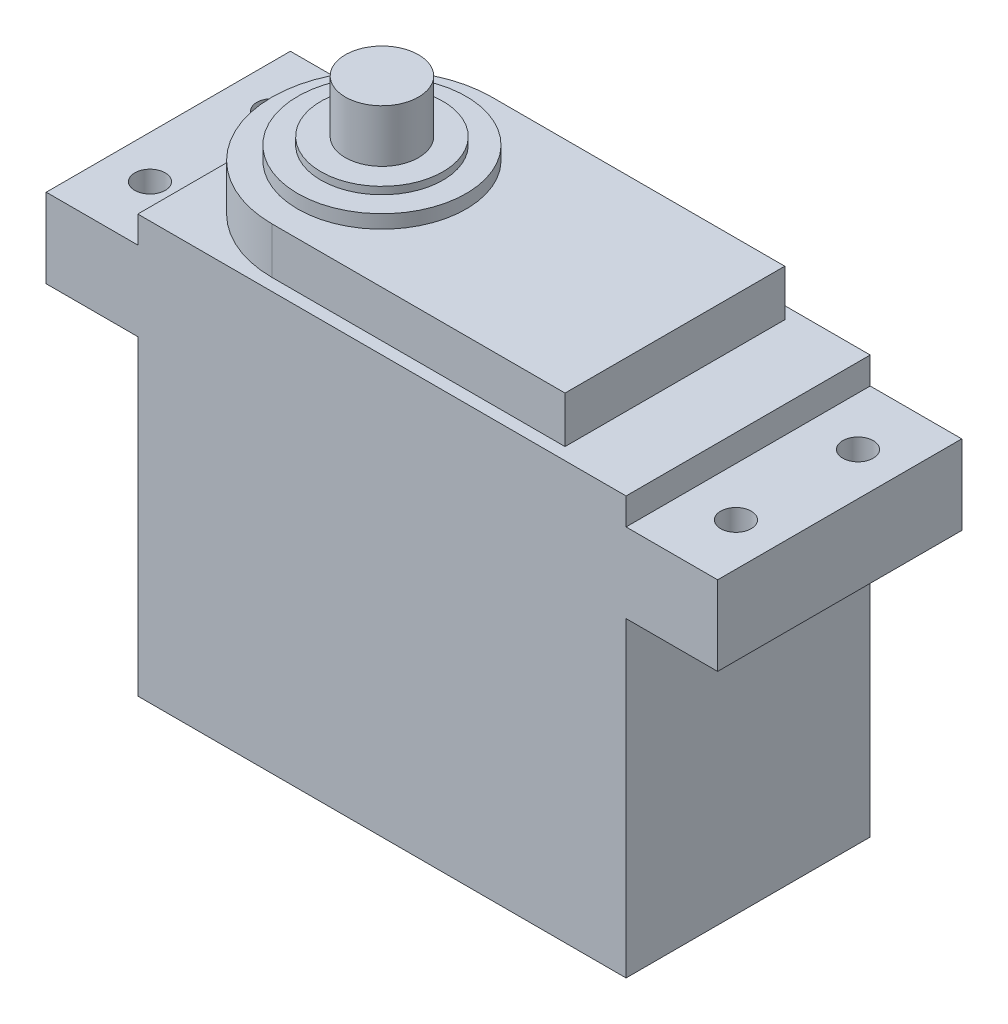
ISO-10303-21;
HEADER;
FILE_DESCRIPTION(('STEP AP214'),'2;1');
FILE_NAME('part.step','',(''),(''),'','','');
FILE_SCHEMA(('AUTOMOTIVE_DESIGN { 1 0 10303 214 1 1 1 1 }'));
ENDSEC;
DATA;
#1=APPLICATION_CONTEXT('core data for automotive mechanical design processes');
#2=APPLICATION_PROTOCOL_DEFINITION('international standard','automotive_design',2000,#1);
#3=PRODUCT_CONTEXT('',#1,'mechanical');
#4=PRODUCT('Part','Part','',(#3));
#5=PRODUCT_RELATED_PRODUCT_CATEGORY('part','',(#4));
#6=PRODUCT_DEFINITION_FORMATION('','',#4);
#7=PRODUCT_DEFINITION_CONTEXT('part definition',#1,'design');
#8=PRODUCT_DEFINITION('design','',#6,#7);
#9=PRODUCT_DEFINITION_SHAPE('','',#8);
#10=(LENGTH_UNIT() NAMED_UNIT(*) SI_UNIT(.MILLI.,.METRE.));
#11=(NAMED_UNIT(*) PLANE_ANGLE_UNIT() SI_UNIT($,.RADIAN.));
#12=(NAMED_UNIT(*) SI_UNIT($,.STERADIAN.) SOLID_ANGLE_UNIT());
#13=UNCERTAINTY_MEASURE_WITH_UNIT(LENGTH_MEASURE(1.E-05),#10,'distance_accuracy_value','');
#14=(GEOMETRIC_REPRESENTATION_CONTEXT(3) GLOBAL_UNCERTAINTY_ASSIGNED_CONTEXT((#13)) GLOBAL_UNIT_ASSIGNED_CONTEXT((#10,
#11,#12)) REPRESENTATION_CONTEXT('',''));
#15=CARTESIAN_POINT('',(0.,0.,0.));
#16=DIRECTION('',(0.,0.,1.));
#17=DIRECTION('',(1.,0.,0.));
#18=AXIS2_PLACEMENT_3D('',#15,#16,#17);
#19=CARTESIAN_POINT('',(0.,0.,10.));
#20=DIRECTION('',(1.,0.,0.));
#21=DIRECTION('',(0.,0.,-1.));
#22=AXIS2_PLACEMENT_3D('',#19,#20,#21);
#23=PLANE('',#22);
#24=DIRECTION('',(0.,-1.,0.));
#25=VECTOR('',#24,1.);
#26=CARTESIAN_POINT('',(0.,0.,-10.));
#27=LINE('',#26,#25);
#28=CARTESIAN_POINT('',(0.,25.5,-10.));
#29=VERTEX_POINT('',#28);
#30=CARTESIAN_POINT('',(0.,0.,-10.));
#31=VERTEX_POINT('',#30);
#32=EDGE_CURVE('E305',#29,#31,#27,.T.);
#33=ORIENTED_EDGE('',*,*,#32,.T.);
#34=DIRECTION('',(0.,0.,-1.));
#35=VECTOR('',#34,1.);
#36=CARTESIAN_POINT('',(0.,0.,10.));
#37=LINE('',#36,#35);
#38=CARTESIAN_POINT('',(0.,0.,10.));
#39=VERTEX_POINT('',#38);
#40=EDGE_CURVE('E12',#39,#31,#37,.T.);
#41=ORIENTED_EDGE('',*,*,#40,.F.);
#42=DIRECTION('',(0.,-1.,0.));
#43=VECTOR('',#42,1.);
#44=CARTESIAN_POINT('',(0.,0.,10.));
#45=LINE('',#44,#43);
#46=CARTESIAN_POINT('',(0.,25.5,10.));
#47=VERTEX_POINT('',#46);
#48=EDGE_CURVE('E278',#47,#39,#45,.T.);
#49=ORIENTED_EDGE('',*,*,#48,.F.);
#50=DIRECTION('',(0.,0.,-1.));
#51=VECTOR('',#50,1.);
#52=CARTESIAN_POINT('',(0.,25.5,10.));
#53=LINE('',#52,#51);
#54=EDGE_CURVE('E304',#47,#29,#53,.T.);
#55=ORIENTED_EDGE('',*,*,#54,.T.);
#56=EDGE_LOOP('',(#33,#41,#49,#55));
#57=FACE_BOUND('',#56,.T.);
#58=DIRECTION('',(0.,-1.,0.));
#59=VECTOR('',#58,1.);
#60=CARTESIAN_POINT('',(0.,3.5,-3.));
#61=LINE('',#60,#59);
#62=CARTESIAN_POINT('',(0.,3.5,-3.));
#63=VERTEX_POINT('',#62);
#64=CARTESIAN_POINT('',(0.,0.5,-3.));
#65=VERTEX_POINT('',#64);
#66=EDGE_CURVE('E199',#63,#65,#61,.T.);
#67=ORIENTED_EDGE('',*,*,#66,.F.);
#68=DIRECTION('',(0.,0.,-1.));
#69=VECTOR('',#68,1.);
#70=CARTESIAN_POINT('',(0.,3.5,-3.));
#71=LINE('',#70,#69);
#72=CARTESIAN_POINT('',(0.,3.5,3.));
#73=VERTEX_POINT('',#72);
#74=EDGE_CURVE('E196',#73,#63,#71,.T.);
#75=ORIENTED_EDGE('',*,*,#74,.F.);
#76=DIRECTION('',(0.,1.,0.));
#77=VECTOR('',#76,1.);
#78=CARTESIAN_POINT('',(0.,3.5,3.));
#79=LINE('',#78,#77);
#80=CARTESIAN_POINT('',(0.,0.5,3.));
#81=VERTEX_POINT('',#80);
#82=EDGE_CURVE('E62',#81,#73,#79,.T.);
#83=ORIENTED_EDGE('',*,*,#82,.F.);
#84=DIRECTION('',(0.,0.,1.));
#85=VECTOR('',#84,1.);
#86=CARTESIAN_POINT('',(0.,0.5,-3.));
#87=LINE('',#86,#85);
#88=EDGE_CURVE('E57',#65,#81,#87,.T.);
#89=ORIENTED_EDGE('',*,*,#88,.F.);
#90=EDGE_LOOP('',(#67,#75,#83,#89));
#91=FACE_BOUND('',#90,.T.);
#92=ADVANCED_FACE('F41',(#57,#91),#23,.F.);
#93=CARTESIAN_POINT('',(0.,39.1,10.));
#94=DIRECTION('',(0.,1.,0.));
#95=DIRECTION('',(0.,0.,1.));
#96=AXIS2_PLACEMENT_3D('',#93,#94,#95);
#97=PLANE('',#96);
#98=CARTESIAN_POINT('',(10.,39.1,0.));
#99=DIRECTION('',(0.,1.,0.));
#100=DIRECTION('',(0.,0.,1.));
#101=AXIS2_PLACEMENT_3D('',#98,#99,#100);
#102=CIRCLE('',#101,6.9);
#103=CARTESIAN_POINT('',(10.,39.1,6.9));
#104=VERTEX_POINT('',#103);
#105=EDGE_CURVE('E220',#104,#104,#102,.T.);
#106=ORIENTED_EDGE('',*,*,#105,.T.);
#107=EDGE_LOOP('',(#106));
#108=FACE_BOUND('',#107,.T.);
#109=CARTESIAN_POINT('',(10.,39.1,0.));
#110=DIRECTION('',(0.,1.,0.));
#111=DIRECTION('',(0.,0.,1.));
#112=AXIS2_PLACEMENT_3D('',#109,#110,#111);
#113=CIRCLE('',#112,5.);
#114=CARTESIAN_POINT('',(10.,39.1,5.));
#115=VERTEX_POINT('',#114);
#116=EDGE_CURVE('E211',#115,#115,#113,.T.);
#117=ORIENTED_EDGE('',*,*,#116,.F.);
#118=EDGE_LOOP('',(#117));
#119=FACE_BOUND('',#118,.T.);
#120=ADVANCED_FACE('F383',(#108,#119),#97,.T.);
#121=CARTESIAN_POINT('',(0.,38.,10.));
#122=DIRECTION('',(0.,1.,0.));
#123=DIRECTION('',(0.,0.,1.));
#124=AXIS2_PLACEMENT_3D('',#121,#122,#123);
#125=PLANE('',#124);
#126=DIRECTION('',(1.,0.,0.));
#127=VECTOR('',#126,1.);
#128=CARTESIAN_POINT('',(34.,38.,9.));
#129=LINE('',#128,#127);
#130=CARTESIAN_POINT('',(10.,38.,9.));
#131=VERTEX_POINT('',#130);
#132=CARTESIAN_POINT('',(34.,38.,9.));
#133=VERTEX_POINT('',#132);
#134=EDGE_CURVE('E227',#131,#133,#129,.T.);
#135=ORIENTED_EDGE('',*,*,#134,.T.);
#136=DIRECTION('',(0.,0.,-1.));
#137=VECTOR('',#136,1.);
#138=CARTESIAN_POINT('',(34.,38.,-9.));
#139=LINE('',#138,#137);
#140=CARTESIAN_POINT('',(34.,38.,-9.));
#141=VERTEX_POINT('',#140);
#142=EDGE_CURVE('E247',#133,#141,#139,.T.);
#143=ORIENTED_EDGE('',*,*,#142,.T.);
#144=DIRECTION('',(-1.,0.,0.));
#145=VECTOR('',#144,1.);
#146=CARTESIAN_POINT('',(10.,38.,-9.));
#147=LINE('',#146,#145);
#148=CARTESIAN_POINT('',(10.,38.,-9.));
#149=VERTEX_POINT('',#148);
#150=EDGE_CURVE('E244',#141,#149,#147,.T.);
#151=ORIENTED_EDGE('',*,*,#150,.T.);
#152=CARTESIAN_POINT('',(10.,38.,0.));
#153=DIRECTION('',(0.,1.,0.));
#154=DIRECTION('',(0.,0.,1.));
#155=AXIS2_PLACEMENT_3D('',#152,#153,#154);
#156=CIRCLE('',#155,9.);
#157=EDGE_CURVE('E240',#149,#131,#156,.T.);
#158=ORIENTED_EDGE('',*,*,#157,.T.);
#159=EDGE_LOOP('',(#135,#143,#151,#158));
#160=FACE_BOUND('',#159,.T.);
#161=CARTESIAN_POINT('',(10.,38.,0.));
#162=DIRECTION('',(0.,1.,0.));
#163=DIRECTION('',(0.,0.,1.));
#164=AXIS2_PLACEMENT_3D('',#161,#162,#163);
#165=CIRCLE('',#164,6.9);
#166=CARTESIAN_POINT('',(10.,38.,6.9));
#167=VERTEX_POINT('',#166);
#168=EDGE_CURVE('E217',#167,#167,#165,.T.);
#169=ORIENTED_EDGE('',*,*,#168,.F.);
#170=EDGE_LOOP('',(#169));
#171=FACE_BOUND('',#170,.T.);
#172=ADVANCED_FACE('F388',(#160,#171),#125,.T.);
#173=CARTESIAN_POINT('',(0.,34.2,10.));
#174=DIRECTION('',(0.,-1.,0.));
#175=DIRECTION('',(0.,0.,-1.));
#176=AXIS2_PLACEMENT_3D('',#173,#174,#175);
#177=PLANE('',#176);
#178=DIRECTION('',(-1.,0.,0.));
#179=VECTOR('',#178,1.);
#180=CARTESIAN_POINT('',(0.,34.2,-10.));
#181=LINE('',#180,#179);
#182=CARTESIAN_POINT('',(40.,34.2,-10.));
#183=VERTEX_POINT('',#182);
#184=CARTESIAN_POINT('',(0.,34.2,-10.));
#185=VERTEX_POINT('',#184);
#186=EDGE_CURVE('E320',#183,#185,#181,.T.);
#187=ORIENTED_EDGE('',*,*,#186,.T.);
#188=DIRECTION('',(0.,0.,-1.));
#189=VECTOR('',#188,1.);
#190=CARTESIAN_POINT('',(0.,34.2,10.));
#191=LINE('',#190,#189);
#192=CARTESIAN_POINT('',(0.,34.2,10.));
#193=VERTEX_POINT('',#192);
#194=EDGE_CURVE('E340',#193,#185,#191,.T.);
#195=ORIENTED_EDGE('',*,*,#194,.F.);
#196=DIRECTION('',(-1.,0.,0.));
#197=VECTOR('',#196,1.);
#198=CARTESIAN_POINT('',(0.,34.2,10.));
#199=LINE('',#198,#197);
#200=CARTESIAN_POINT('',(40.,34.2,10.));
#201=VERTEX_POINT('',#200);
#202=EDGE_CURVE('E294',#201,#193,#199,.T.);
#203=ORIENTED_EDGE('',*,*,#202,.F.);
#204=DIRECTION('',(0.,0.,-1.));
#205=VECTOR('',#204,1.);
#206=CARTESIAN_POINT('',(40.,34.2,10.));
#207=LINE('',#206,#205);
#208=EDGE_CURVE('E343',#201,#183,#207,.T.);
#209=ORIENTED_EDGE('',*,*,#208,.T.);
#210=EDGE_LOOP('',(#187,#195,#203,#209));
#211=FACE_BOUND('',#210,.T.);
#212=DIRECTION('',(0.,0.,-1.));
#213=VECTOR('',#212,1.);
#214=CARTESIAN_POINT('',(34.,34.2,-9.));
#215=LINE('',#214,#213);
#216=CARTESIAN_POINT('',(34.,34.2,9.));
#217=VERTEX_POINT('',#216);
#218=CARTESIAN_POINT('',(34.,34.2,-9.));
#219=VERTEX_POINT('',#218);
#220=EDGE_CURVE('E237',#217,#219,#215,.T.);
#221=ORIENTED_EDGE('',*,*,#220,.F.);
#222=DIRECTION('',(1.,0.,0.));
#223=VECTOR('',#222,1.);
#224=CARTESIAN_POINT('',(34.,34.2,9.));
#225=LINE('',#224,#223);
#226=CARTESIAN_POINT('',(10.,34.2,9.));
#227=VERTEX_POINT('',#226);
#228=EDGE_CURVE('E224',#227,#217,#225,.T.);
#229=ORIENTED_EDGE('',*,*,#228,.F.);
#230=CARTESIAN_POINT('',(10.,34.2,0.));
#231=DIRECTION('',(0.,1.,0.));
#232=DIRECTION('',(0.,0.,1.));
#233=AXIS2_PLACEMENT_3D('',#230,#231,#232);
#234=CIRCLE('',#233,9.);
#235=CARTESIAN_POINT('',(10.,34.2,-9.));
#236=VERTEX_POINT('',#235);
#237=EDGE_CURVE('E229',#236,#227,#234,.T.);
#238=ORIENTED_EDGE('',*,*,#237,.F.);
#239=DIRECTION('',(-1.,0.,0.));
#240=VECTOR('',#239,1.);
#241=CARTESIAN_POINT('',(10.,34.2,-9.));
#242=LINE('',#241,#240);
#243=EDGE_CURVE('E233',#219,#236,#242,.T.);
#244=ORIENTED_EDGE('',*,*,#243,.F.);
#245=EDGE_LOOP('',(#221,#229,#238,#244));
#246=FACE_BOUND('',#245,.T.);
#247=ADVANCED_FACE('F505',(#211,#246),#177,.F.);
#248=CARTESIAN_POINT('',(0.,0.,10.));
#249=DIRECTION('',(0.,1.,0.));
#250=DIRECTION('',(0.,0.,1.));
#251=AXIS2_PLACEMENT_3D('',#248,#249,#250);
#252=PLANE('',#251);
#253=DIRECTION('',(1.,0.,0.));
#254=VECTOR('',#253,1.);
#255=CARTESIAN_POINT('',(0.,0.,-10.));
#256=LINE('',#255,#254);
#257=CARTESIAN_POINT('',(40.,0.,-10.));
#258=VERTEX_POINT('',#257);
#259=EDGE_CURVE('E308',#31,#258,#256,.T.);
#260=ORIENTED_EDGE('',*,*,#259,.T.);
#261=DIRECTION('',(0.,0.,-1.));
#262=VECTOR('',#261,1.);
#263=CARTESIAN_POINT('',(40.,0.,10.));
#264=LINE('',#263,#262);
#265=CARTESIAN_POINT('',(40.,0.,10.));
#266=VERTEX_POINT('',#265);
#267=EDGE_CURVE('E49',#266,#258,#264,.T.);
#268=ORIENTED_EDGE('',*,*,#267,.F.);
#269=DIRECTION('',(1.,0.,0.));
#270=VECTOR('',#269,1.);
#271=CARTESIAN_POINT('',(0.,0.,10.));
#272=LINE('',#271,#270);
#273=EDGE_CURVE('E281',#39,#266,#272,.T.);
#274=ORIENTED_EDGE('',*,*,#273,.F.);
#275=ORIENTED_EDGE('',*,*,#40,.T.);
#276=EDGE_LOOP('',(#260,#268,#274,#275));
#277=FACE_BOUND('',#276,.T.);
#278=ADVANCED_FACE('F553',(#277),#252,.F.);
#279=CARTESIAN_POINT('',(40.,0.,10.));
#280=DIRECTION('',(-1.,0.,0.));
#281=DIRECTION('',(0.,0.,1.));
#282=AXIS2_PLACEMENT_3D('',#279,#280,#281);
#283=PLANE('',#282);
#284=DIRECTION('',(0.,1.,0.));
#285=VECTOR('',#284,1.);
#286=CARTESIAN_POINT('',(40.,0.,-10.));
#287=LINE('',#286,#285);
#288=CARTESIAN_POINT('',(40.,25.5,-10.));
#289=VERTEX_POINT('',#288);
#290=EDGE_CURVE('E310',#258,#289,#287,.T.);
#291=ORIENTED_EDGE('',*,*,#290,.T.);
#292=DIRECTION('',(0.,0.,-1.));
#293=VECTOR('',#292,1.);
#294=CARTESIAN_POINT('',(40.,25.5,10.));
#295=LINE('',#294,#293);
#296=CARTESIAN_POINT('',(40.,25.5,10.));
#297=VERTEX_POINT('',#296);
#298=EDGE_CURVE('E355',#297,#289,#295,.T.);
#299=ORIENTED_EDGE('',*,*,#298,.F.);
#300=DIRECTION('',(0.,1.,0.));
#301=VECTOR('',#300,1.);
#302=CARTESIAN_POINT('',(40.,0.,10.));
#303=LINE('',#302,#301);
#304=EDGE_CURVE('E284',#266,#297,#303,.T.);
#305=ORIENTED_EDGE('',*,*,#304,.F.);
#306=ORIENTED_EDGE('',*,*,#267,.T.);
#307=EDGE_LOOP('',(#291,#299,#305,#306));
#308=FACE_BOUND('',#307,.T.);
#309=ADVANCED_FACE('F522',(#308),#283,.F.);
#310=CARTESIAN_POINT('',(40.,25.5,10.));
#311=DIRECTION('',(0.,1.,0.));
#312=DIRECTION('',(0.,0.,1.));
#313=AXIS2_PLACEMENT_3D('',#310,#311,#312);
#314=PLANE('',#313);
#315=CARTESIAN_POINT('',(44.,25.5,-4.99999999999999));
#316=DIRECTION('',(0.,1.,0.));
#317=DIRECTION('',(0.,0.,1.));
#318=AXIS2_PLACEMENT_3D('',#315,#316,#317);
#319=CIRCLE('',#318,1.25);
#320=CARTESIAN_POINT('',(44.,25.5,-3.75));
#321=VERTEX_POINT('',#320);
#322=EDGE_CURVE('E262',#321,#321,#319,.T.);
#323=ORIENTED_EDGE('',*,*,#322,.T.);
#324=EDGE_LOOP('',(#323));
#325=FACE_BOUND('',#324,.T.);
#326=CARTESIAN_POINT('',(44.,25.5,5.00000000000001));
#327=DIRECTION('',(0.,1.,0.));
#328=DIRECTION('',(0.,0.,1.));
#329=AXIS2_PLACEMENT_3D('',#326,#327,#328);
#330=CIRCLE('',#329,1.25);
#331=CARTESIAN_POINT('',(44.,25.5,6.25));
#332=VERTEX_POINT('',#331);
#333=EDGE_CURVE('E268',#332,#332,#330,.T.);
#334=ORIENTED_EDGE('',*,*,#333,.T.);
#335=EDGE_LOOP('',(#334));
#336=FACE_BOUND('',#335,.T.);
#337=DIRECTION('',(1.,0.,0.));
#338=VECTOR('',#337,1.);
#339=CARTESIAN_POINT('',(40.,25.5,-10.));
#340=LINE('',#339,#338);
#341=CARTESIAN_POINT('',(47.5,25.5,-10.));
#342=VERTEX_POINT('',#341);
#343=EDGE_CURVE('E312',#289,#342,#340,.T.);
#344=ORIENTED_EDGE('',*,*,#343,.T.);
#345=DIRECTION('',(0.,0.,-1.));
#346=VECTOR('',#345,1.);
#347=CARTESIAN_POINT('',(47.5,25.5,10.));
#348=LINE('',#347,#346);
#349=CARTESIAN_POINT('',(47.5,25.5,10.));
#350=VERTEX_POINT('',#349);
#351=EDGE_CURVE('E352',#350,#342,#348,.T.);
#352=ORIENTED_EDGE('',*,*,#351,.F.);
#353=DIRECTION('',(1.,0.,0.));
#354=VECTOR('',#353,1.);
#355=CARTESIAN_POINT('',(40.,25.5,10.));
#356=LINE('',#355,#354);
#357=EDGE_CURVE('E286',#297,#350,#356,.T.);
#358=ORIENTED_EDGE('',*,*,#357,.F.);
#359=ORIENTED_EDGE('',*,*,#298,.T.);
#360=EDGE_LOOP('',(#344,#352,#358,#359));
#361=FACE_BOUND('',#360,.T.);
#362=ADVANCED_FACE('F518',(#325,#336,#361),#314,.F.);
#363=CARTESIAN_POINT('',(47.5,25.5,10.));
#364=DIRECTION('',(-1.,0.,0.));
#365=DIRECTION('',(0.,0.,1.));
#366=AXIS2_PLACEMENT_3D('',#363,#364,#365);
#367=PLANE('',#366);
#368=DIRECTION('',(0.,1.,0.));
#369=VECTOR('',#368,1.);
#370=CARTESIAN_POINT('',(47.5,25.5,-10.));
#371=LINE('',#370,#369);
#372=CARTESIAN_POINT('',(47.5,32.,-10.));
#373=VERTEX_POINT('',#372);
#374=EDGE_CURVE('E314',#342,#373,#371,.T.);
#375=ORIENTED_EDGE('',*,*,#374,.T.);
#376=DIRECTION('',(0.,0.,-1.));
#377=VECTOR('',#376,1.);
#378=CARTESIAN_POINT('',(47.5,32.,10.));
#379=LINE('',#378,#377);
#380=CARTESIAN_POINT('',(47.5,32.,10.));
#381=VERTEX_POINT('',#380);
#382=EDGE_CURVE('E349',#381,#373,#379,.T.);
#383=ORIENTED_EDGE('',*,*,#382,.F.);
#384=DIRECTION('',(0.,1.,0.));
#385=VECTOR('',#384,1.);
#386=CARTESIAN_POINT('',(47.5,25.5,10.));
#387=LINE('',#386,#385);
#388=EDGE_CURVE('E288',#350,#381,#387,.T.);
#389=ORIENTED_EDGE('',*,*,#388,.F.);
#390=ORIENTED_EDGE('',*,*,#351,.T.);
#391=EDGE_LOOP('',(#375,#383,#389,#390));
#392=FACE_BOUND('',#391,.T.);
#393=ADVANCED_FACE('F521',(#392),#367,.F.);
#394=CARTESIAN_POINT('',(47.5,32.,10.));
#395=DIRECTION('',(0.,-1.,0.));
#396=DIRECTION('',(0.,0.,-1.));
#397=AXIS2_PLACEMENT_3D('',#394,#395,#396);
#398=PLANE('',#397);
#399=CARTESIAN_POINT('',(44.,32.,-4.99999999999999));
#400=DIRECTION('',(0.,1.,0.));
#401=DIRECTION('',(0.,0.,1.));
#402=AXIS2_PLACEMENT_3D('',#399,#400,#401);
#403=CIRCLE('',#402,1.25);
#404=CARTESIAN_POINT('',(44.,32.,-3.75));
#405=VERTEX_POINT('',#404);
#406=EDGE_CURVE('E243',#405,#405,#403,.T.);
#407=ORIENTED_EDGE('',*,*,#406,.F.);
#408=EDGE_LOOP('',(#407));
#409=FACE_BOUND('',#408,.T.);
#410=CARTESIAN_POINT('',(44.,32.,5.00000000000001));
#411=DIRECTION('',(0.,1.,0.));
#412=DIRECTION('',(0.,0.,1.));
#413=AXIS2_PLACEMENT_3D('',#410,#411,#412);
#414=CIRCLE('',#413,1.25);
#415=CARTESIAN_POINT('',(44.,32.,6.25));
#416=VERTEX_POINT('',#415);
#417=EDGE_CURVE('E265',#416,#416,#414,.T.);
#418=ORIENTED_EDGE('',*,*,#417,.F.);
#419=EDGE_LOOP('',(#418));
#420=FACE_BOUND('',#419,.T.);
#421=DIRECTION('',(-1.,0.,0.));
#422=VECTOR('',#421,1.);
#423=CARTESIAN_POINT('',(47.5,32.,-10.));
#424=LINE('',#423,#422);
#425=CARTESIAN_POINT('',(40.,32.,-10.));
#426=VERTEX_POINT('',#425);
#427=EDGE_CURVE('E316',#373,#426,#424,.T.);
#428=ORIENTED_EDGE('',*,*,#427,.T.);
#429=DIRECTION('',(0.,0.,-1.));
#430=VECTOR('',#429,1.);
#431=CARTESIAN_POINT('',(40.,32.,10.));
#432=LINE('',#431,#430);
#433=CARTESIAN_POINT('',(40.,32.,10.));
#434=VERTEX_POINT('',#433);
#435=EDGE_CURVE('E346',#434,#426,#432,.T.);
#436=ORIENTED_EDGE('',*,*,#435,.F.);
#437=DIRECTION('',(-1.,0.,0.));
#438=VECTOR('',#437,1.);
#439=CARTESIAN_POINT('',(47.5,32.,10.));
#440=LINE('',#439,#438);
#441=EDGE_CURVE('E290',#381,#434,#440,.T.);
#442=ORIENTED_EDGE('',*,*,#441,.F.);
#443=ORIENTED_EDGE('',*,*,#382,.T.);
#444=EDGE_LOOP('',(#428,#436,#442,#443));
#445=FACE_BOUND('',#444,.T.);
#446=ADVANCED_FACE('F539',(#409,#420,#445),#398,.F.);
#447=CARTESIAN_POINT('',(40.,32.,10.));
#448=DIRECTION('',(-1.,0.,0.));
#449=DIRECTION('',(0.,0.,1.));
#450=AXIS2_PLACEMENT_3D('',#447,#448,#449);
#451=PLANE('',#450);
#452=DIRECTION('',(0.,1.,0.));
#453=VECTOR('',#452,1.);
#454=CARTESIAN_POINT('',(40.,32.,-10.));
#455=LINE('',#454,#453);
#456=EDGE_CURVE('E318',#426,#183,#455,.T.);
#457=ORIENTED_EDGE('',*,*,#456,.T.);
#458=ORIENTED_EDGE('',*,*,#208,.F.);
#459=DIRECTION('',(0.,1.,0.));
#460=VECTOR('',#459,1.);
#461=CARTESIAN_POINT('',(40.,32.,10.));
#462=LINE('',#461,#460);
#463=EDGE_CURVE('E292',#434,#201,#462,.T.);
#464=ORIENTED_EDGE('',*,*,#463,.F.);
#465=ORIENTED_EDGE('',*,*,#435,.T.);
#466=EDGE_LOOP('',(#457,#458,#464,#465));
#467=FACE_BOUND('',#466,.T.);
#468=ADVANCED_FACE('F543',(#467),#451,.F.);
#469=CARTESIAN_POINT('',(0.,32.,10.));
#470=DIRECTION('',(1.,0.,0.));
#471=DIRECTION('',(0.,0.,-1.));
#472=AXIS2_PLACEMENT_3D('',#469,#470,#471);
#473=PLANE('',#472);
#474=DIRECTION('',(0.,-1.,0.));
#475=VECTOR('',#474,1.);
#476=CARTESIAN_POINT('',(0.,32.,-10.));
#477=LINE('',#476,#475);
#478=CARTESIAN_POINT('',(0.,32.,-10.));
#479=VERTEX_POINT('',#478);
#480=EDGE_CURVE('E322',#185,#479,#477,.T.);
#481=ORIENTED_EDGE('',*,*,#480,.T.);
#482=DIRECTION('',(0.,0.,-1.));
#483=VECTOR('',#482,1.);
#484=CARTESIAN_POINT('',(0.,32.,10.));
#485=LINE('',#484,#483);
#486=CARTESIAN_POINT('',(0.,32.,10.));
#487=VERTEX_POINT('',#486);
#488=EDGE_CURVE('E337',#487,#479,#485,.T.);
#489=ORIENTED_EDGE('',*,*,#488,.F.);
#490=DIRECTION('',(0.,-1.,0.));
#491=VECTOR('',#490,1.);
#492=CARTESIAN_POINT('',(0.,32.,10.));
#493=LINE('',#492,#491);
#494=EDGE_CURVE('E296',#193,#487,#493,.T.);
#495=ORIENTED_EDGE('',*,*,#494,.F.);
#496=ORIENTED_EDGE('',*,*,#194,.T.);
#497=EDGE_LOOP('',(#481,#489,#495,#496));
#498=FACE_BOUND('',#497,.T.);
#499=ADVANCED_FACE('F571',(#498),#473,.F.);
#500=CARTESIAN_POINT('',(0.,32.,10.));
#501=DIRECTION('',(0.,-1.,0.));
#502=DIRECTION('',(0.,0.,-1.));
#503=AXIS2_PLACEMENT_3D('',#500,#501,#502);
#504=PLANE('',#503);
#505=CARTESIAN_POINT('',(-4.,32.,5.00000000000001));
#506=DIRECTION('',(0.,1.,0.));
#507=DIRECTION('',(0.,0.,1.));
#508=AXIS2_PLACEMENT_3D('',#505,#506,#507);
#509=CIRCLE('',#508,1.25);
#510=CARTESIAN_POINT('',(-4.,32.,6.25000000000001));
#511=VERTEX_POINT('',#510);
#512=EDGE_CURVE('E271',#511,#511,#509,.T.);
#513=ORIENTED_EDGE('',*,*,#512,.F.);
#514=EDGE_LOOP('',(#513));
#515=FACE_BOUND('',#514,.T.);
#516=CARTESIAN_POINT('',(-4.,32.,-5.00000000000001));
#517=DIRECTION('',(0.,1.,0.));
#518=DIRECTION('',(0.,0.,1.));
#519=AXIS2_PLACEMENT_3D('',#516,#517,#518);
#520=CIRCLE('',#519,1.25);
#521=CARTESIAN_POINT('',(-4.,32.,-3.75));
#522=VERTEX_POINT('',#521);
#523=EDGE_CURVE('E274',#522,#522,#520,.T.);
#524=ORIENTED_EDGE('',*,*,#523,.F.);
#525=EDGE_LOOP('',(#524));
#526=FACE_BOUND('',#525,.T.);
#527=DIRECTION('',(-1.,0.,0.));
#528=VECTOR('',#527,1.);
#529=CARTESIAN_POINT('',(0.,32.,-10.));
#530=LINE('',#529,#528);
#531=CARTESIAN_POINT('',(-7.5,32.,-10.));
#532=VERTEX_POINT('',#531);
#533=EDGE_CURVE('E324',#479,#532,#530,.T.);
#534=ORIENTED_EDGE('',*,*,#533,.T.);
#535=DIRECTION('',(0.,0.,-1.));
#536=VECTOR('',#535,1.);
#537=CARTESIAN_POINT('',(-7.5,32.,10.));
#538=LINE('',#537,#536);
#539=CARTESIAN_POINT('',(-7.5,32.,10.));
#540=VERTEX_POINT('',#539);
#541=EDGE_CURVE('E334',#540,#532,#538,.T.);
#542=ORIENTED_EDGE('',*,*,#541,.F.);
#543=DIRECTION('',(-1.,0.,0.));
#544=VECTOR('',#543,1.);
#545=CARTESIAN_POINT('',(0.,32.,10.));
#546=LINE('',#545,#544);
#547=EDGE_CURVE('E298',#487,#540,#546,.T.);
#548=ORIENTED_EDGE('',*,*,#547,.F.);
#549=ORIENTED_EDGE('',*,*,#488,.T.);
#550=EDGE_LOOP('',(#534,#542,#548,#549));
#551=FACE_BOUND('',#550,.T.);
#552=ADVANCED_FACE('F567',(#515,#526,#551),#504,.F.);
#553=CARTESIAN_POINT('',(-7.5,25.5,10.));
#554=DIRECTION('',(1.,0.,0.));
#555=DIRECTION('',(0.,0.,-1.));
#556=AXIS2_PLACEMENT_3D('',#553,#554,#555);
#557=PLANE('',#556);
#558=DIRECTION('',(0.,-1.,0.));
#559=VECTOR('',#558,1.);
#560=CARTESIAN_POINT('',(-7.5,25.5,-10.));
#561=LINE('',#560,#559);
#562=CARTESIAN_POINT('',(-7.5,25.5,-10.));
#563=VERTEX_POINT('',#562);
#564=EDGE_CURVE('E326',#532,#563,#561,.T.);
#565=ORIENTED_EDGE('',*,*,#564,.T.);
#566=DIRECTION('',(0.,0.,-1.));
#567=VECTOR('',#566,1.);
#568=CARTESIAN_POINT('',(-7.5,25.5,10.));
#569=LINE('',#568,#567);
#570=CARTESIAN_POINT('',(-7.5,25.5,10.));
#571=VERTEX_POINT('',#570);
#572=EDGE_CURVE('E331',#571,#563,#569,.T.);
#573=ORIENTED_EDGE('',*,*,#572,.F.);
#574=DIRECTION('',(0.,-1.,0.));
#575=VECTOR('',#574,1.);
#576=CARTESIAN_POINT('',(-7.5,25.5,10.));
#577=LINE('',#576,#575);
#578=EDGE_CURVE('E300',#540,#571,#577,.T.);
#579=ORIENTED_EDGE('',*,*,#578,.F.);
#580=ORIENTED_EDGE('',*,*,#541,.T.);
#581=EDGE_LOOP('',(#565,#573,#579,#580));
#582=FACE_BOUND('',#581,.T.);
#583=ADVANCED_FACE('F563',(#582),#557,.F.);
#584=CARTESIAN_POINT('',(-7.5,25.5,10.));
#585=DIRECTION('',(0.,1.,0.));
#586=DIRECTION('',(0.,0.,1.));
#587=AXIS2_PLACEMENT_3D('',#584,#585,#586);
#588=PLANE('',#587);
#589=CARTESIAN_POINT('',(-4.,25.5,5.00000000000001));
#590=DIRECTION('',(0.,1.,0.));
#591=DIRECTION('',(0.,0.,1.));
#592=AXIS2_PLACEMENT_3D('',#589,#590,#591);
#593=CIRCLE('',#592,1.25);
#594=CARTESIAN_POINT('',(-4.,25.5,6.25000000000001));
#595=VERTEX_POINT('',#594);
#596=EDGE_CURVE('E44',#595,#595,#593,.T.);
#597=ORIENTED_EDGE('',*,*,#596,.T.);
#598=EDGE_LOOP('',(#597));
#599=FACE_BOUND('',#598,.T.);
#600=CARTESIAN_POINT('',(-4.,25.5,-5.00000000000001));
#601=DIRECTION('',(0.,1.,0.));
#602=DIRECTION('',(0.,0.,1.));
#603=AXIS2_PLACEMENT_3D('',#600,#601,#602);
#604=CIRCLE('',#603,1.25);
#605=CARTESIAN_POINT('',(-4.,25.5,-3.75));
#606=VERTEX_POINT('',#605);
#607=EDGE_CURVE('E277',#606,#606,#604,.T.);
#608=ORIENTED_EDGE('',*,*,#607,.T.);
#609=EDGE_LOOP('',(#608));
#610=FACE_BOUND('',#609,.T.);
#611=DIRECTION('',(1.,0.,0.));
#612=VECTOR('',#611,1.);
#613=CARTESIAN_POINT('',(-7.5,25.5,-10.));
#614=LINE('',#613,#612);
#615=EDGE_CURVE('E282',#563,#29,#614,.T.);
#616=ORIENTED_EDGE('',*,*,#615,.T.);
#617=ORIENTED_EDGE('',*,*,#54,.F.);
#618=DIRECTION('',(1.,0.,0.));
#619=VECTOR('',#618,1.);
#620=CARTESIAN_POINT('',(-7.5,25.5,10.));
#621=LINE('',#620,#619);
#622=EDGE_CURVE('E302',#571,#47,#621,.T.);
#623=ORIENTED_EDGE('',*,*,#622,.F.);
#624=ORIENTED_EDGE('',*,*,#572,.T.);
#625=EDGE_LOOP('',(#616,#617,#623,#624));
#626=FACE_BOUND('',#625,.T.);
#627=ADVANCED_FACE('F362',(#599,#610,#626),#588,.F.);
#628=CARTESIAN_POINT('',(0.,25.5,10.));
#629=DIRECTION('',(0.,0.,-1.));
#630=DIRECTION('',(-1.,0.,0.));
#631=AXIS2_PLACEMENT_3D('',#628,#629,#630);
#632=PLANE('',#631);
#633=ORIENTED_EDGE('',*,*,#48,.T.);
#634=ORIENTED_EDGE('',*,*,#273,.T.);
#635=ORIENTED_EDGE('',*,*,#304,.T.);
#636=ORIENTED_EDGE('',*,*,#357,.T.);
#637=ORIENTED_EDGE('',*,*,#388,.T.);
#638=ORIENTED_EDGE('',*,*,#441,.T.);
#639=ORIENTED_EDGE('',*,*,#463,.T.);
#640=ORIENTED_EDGE('',*,*,#202,.T.);
#641=ORIENTED_EDGE('',*,*,#494,.T.);
#642=ORIENTED_EDGE('',*,*,#547,.T.);
#643=ORIENTED_EDGE('',*,*,#578,.T.);
#644=ORIENTED_EDGE('',*,*,#622,.T.);
#645=EDGE_LOOP('',(#633,#634,#635,#636,#637,#638,#639,#640,#641,#642,#643,#644));
#646=FACE_BOUND('',#645,.T.);
#647=ADVANCED_FACE('F378',(#646),#632,.F.);
#648=CARTESIAN_POINT('',(0.,25.5,-10.));
#649=DIRECTION('',(0.,0.,-1.));
#650=DIRECTION('',(-1.,0.,0.));
#651=AXIS2_PLACEMENT_3D('',#648,#649,#650);
#652=PLANE('',#651);
#653=ORIENTED_EDGE('',*,*,#32,.F.);
#654=ORIENTED_EDGE('',*,*,#615,.F.);
#655=ORIENTED_EDGE('',*,*,#564,.F.);
#656=ORIENTED_EDGE('',*,*,#533,.F.);
#657=ORIENTED_EDGE('',*,*,#480,.F.);
#658=ORIENTED_EDGE('',*,*,#186,.F.);
#659=ORIENTED_EDGE('',*,*,#456,.F.);
#660=ORIENTED_EDGE('',*,*,#427,.F.);
#661=ORIENTED_EDGE('',*,*,#374,.F.);
#662=ORIENTED_EDGE('',*,*,#343,.F.);
#663=ORIENTED_EDGE('',*,*,#290,.F.);
#664=ORIENTED_EDGE('',*,*,#259,.F.);
#665=EDGE_LOOP('',(#653,#654,#655,#656,#657,#658,#659,#660,#661,#662,#663,#664));
#666=FACE_BOUND('',#665,.T.);
#667=ADVANCED_FACE('F368',(#666),#652,.T.);
#668=CARTESIAN_POINT('',(-4.,0.,-5.00000000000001));
#669=DIRECTION('',(0.,1.,0.));
#670=DIRECTION('',(0.,0.,1.));
#671=AXIS2_PLACEMENT_3D('',#668,#669,#670);
#672=CYLINDRICAL_SURFACE('',#671,1.25);
#673=ORIENTED_EDGE('',*,*,#523,.T.);
#674=EDGE_LOOP('',(#673));
#675=FACE_BOUND('',#674,.T.);
#676=ORIENTED_EDGE('',*,*,#607,.F.);
#677=EDGE_LOOP('',(#676));
#678=FACE_BOUND('',#677,.T.);
#679=ADVANCED_FACE('F365',(#675,#678),#672,.F.);
#680=CARTESIAN_POINT('',(-4.,0.,5.00000000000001));
#681=DIRECTION('',(0.,1.,0.));
#682=DIRECTION('',(0.,0.,1.));
#683=AXIS2_PLACEMENT_3D('',#680,#681,#682);
#684=CYLINDRICAL_SURFACE('',#683,1.25);
#685=ORIENTED_EDGE('',*,*,#512,.T.);
#686=EDGE_LOOP('',(#685));
#687=FACE_BOUND('',#686,.T.);
#688=ORIENTED_EDGE('',*,*,#596,.F.);
#689=EDGE_LOOP('',(#688));
#690=FACE_BOUND('',#689,.T.);
#691=ADVANCED_FACE('F367',(#687,#690),#684,.F.);
#692=CARTESIAN_POINT('',(44.,0.,5.00000000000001));
#693=DIRECTION('',(0.,1.,0.));
#694=DIRECTION('',(0.,0.,1.));
#695=AXIS2_PLACEMENT_3D('',#692,#693,#694);
#696=CYLINDRICAL_SURFACE('',#695,1.25);
#697=ORIENTED_EDGE('',*,*,#417,.T.);
#698=EDGE_LOOP('',(#697));
#699=FACE_BOUND('',#698,.T.);
#700=ORIENTED_EDGE('',*,*,#333,.F.);
#701=EDGE_LOOP('',(#700));
#702=FACE_BOUND('',#701,.T.);
#703=ADVANCED_FACE('F375',(#699,#702),#696,.F.);
#704=CARTESIAN_POINT('',(44.,0.,-4.99999999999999));
#705=DIRECTION('',(0.,1.,0.));
#706=DIRECTION('',(0.,0.,1.));
#707=AXIS2_PLACEMENT_3D('',#704,#705,#706);
#708=CYLINDRICAL_SURFACE('',#707,1.25);
#709=ORIENTED_EDGE('',*,*,#406,.T.);
#710=EDGE_LOOP('',(#709));
#711=FACE_BOUND('',#710,.T.);
#712=ORIENTED_EDGE('',*,*,#322,.F.);
#713=EDGE_LOOP('',(#712));
#714=FACE_BOUND('',#713,.T.);
#715=ADVANCED_FACE('F501',(#711,#714),#708,.F.);
#716=CARTESIAN_POINT('',(34.,113.589892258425,-9.));
#717=DIRECTION('',(-1.,0.,0.));
#718=DIRECTION('',(0.,0.,1.));
#719=AXIS2_PLACEMENT_3D('',#716,#717,#718);
#720=PLANE('',#719);
#721=ORIENTED_EDGE('',*,*,#142,.F.);
#722=DIRECTION('',(0.,-1.,0.));
#723=VECTOR('',#722,1.);
#724=CARTESIAN_POINT('',(34.,113.589892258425,9.));
#725=LINE('',#724,#723);
#726=EDGE_CURVE('E223',#133,#217,#725,.T.);
#727=ORIENTED_EDGE('',*,*,#726,.T.);
#728=ORIENTED_EDGE('',*,*,#220,.T.);
#729=DIRECTION('',(0.,-1.,0.));
#730=VECTOR('',#729,1.);
#731=CARTESIAN_POINT('',(34.,113.589892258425,-9.));
#732=LINE('',#731,#730);
#733=EDGE_CURVE('E236',#141,#219,#732,.T.);
#734=ORIENTED_EDGE('',*,*,#733,.F.);
#735=EDGE_LOOP('',(#721,#727,#728,#734));
#736=FACE_BOUND('',#735,.T.);
#737=ADVANCED_FACE('F497',(#736),#720,.F.);
#738=CARTESIAN_POINT('',(10.,113.589892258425,-9.));
#739=DIRECTION('',(0.,0.,1.));
#740=DIRECTION('',(1.,0.,0.));
#741=AXIS2_PLACEMENT_3D('',#738,#739,#740);
#742=PLANE('',#741);
#743=ORIENTED_EDGE('',*,*,#150,.F.);
#744=ORIENTED_EDGE('',*,*,#733,.T.);
#745=ORIENTED_EDGE('',*,*,#243,.T.);
#746=DIRECTION('',(0.,-1.,0.));
#747=VECTOR('',#746,1.);
#748=CARTESIAN_POINT('',(10.,113.589892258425,-9.));
#749=LINE('',#748,#747);
#750=EDGE_CURVE('E232',#149,#236,#749,.T.);
#751=ORIENTED_EDGE('',*,*,#750,.F.);
#752=EDGE_LOOP('',(#743,#744,#745,#751));
#753=FACE_BOUND('',#752,.T.);
#754=ADVANCED_FACE('F493',(#753),#742,.F.);
#755=CARTESIAN_POINT('',(10.,113.589892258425,0.));
#756=DIRECTION('',(0.,-1.,0.));
#757=DIRECTION('',(0.,0.,-1.));
#758=AXIS2_PLACEMENT_3D('',#755,#756,#757);
#759=CYLINDRICAL_SURFACE('',#758,9.);
#760=ORIENTED_EDGE('',*,*,#157,.F.);
#761=ORIENTED_EDGE('',*,*,#750,.T.);
#762=ORIENTED_EDGE('',*,*,#237,.T.);
#763=DIRECTION('',(0.,-1.,0.));
#764=VECTOR('',#763,1.);
#765=CARTESIAN_POINT('',(10.,113.589892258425,9.));
#766=LINE('',#765,#764);
#767=EDGE_CURVE('E228',#131,#227,#766,.T.);
#768=ORIENTED_EDGE('',*,*,#767,.F.);
#769=EDGE_LOOP('',(#760,#761,#762,#768));
#770=FACE_BOUND('',#769,.T.);
#771=ADVANCED_FACE('F489',(#770),#759,.T.);
#772=CARTESIAN_POINT('',(34.,113.589892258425,9.));
#773=DIRECTION('',(0.,0.,-1.));
#774=DIRECTION('',(-1.,0.,0.));
#775=AXIS2_PLACEMENT_3D('',#772,#773,#774);
#776=PLANE('',#775);
#777=ORIENTED_EDGE('',*,*,#134,.F.);
#778=ORIENTED_EDGE('',*,*,#767,.T.);
#779=ORIENTED_EDGE('',*,*,#228,.T.);
#780=ORIENTED_EDGE('',*,*,#726,.F.);
#781=EDGE_LOOP('',(#777,#778,#779,#780));
#782=FACE_BOUND('',#781,.T.);
#783=ADVANCED_FACE('F484',(#782),#776,.F.);
#784=CARTESIAN_POINT('',(10.,97.7161471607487,0.));
#785=DIRECTION('',(0.,-1.,0.));
#786=DIRECTION('',(0.,0.,-1.));
#787=AXIS2_PLACEMENT_3D('',#784,#785,#786);
#788=CYLINDRICAL_SURFACE('',#787,6.9);
#789=ORIENTED_EDGE('',*,*,#168,.T.);
#790=EDGE_LOOP('',(#789));
#791=FACE_BOUND('',#790,.T.);
#792=ORIENTED_EDGE('',*,*,#105,.F.);
#793=EDGE_LOOP('',(#792));
#794=FACE_BOUND('',#793,.T.);
#795=ADVANCED_FACE('F478',(#791,#794),#788,.T.);
#796=CARTESIAN_POINT('',(10.,93.542135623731,0.));
#797=DIRECTION('',(0.,-1.,0.));
#798=DIRECTION('',(0.,0.,-1.));
#799=AXIS2_PLACEMENT_3D('',#796,#797,#798);
#800=CYLINDRICAL_SURFACE('',#799,5.);
#801=ORIENTED_EDGE('',*,*,#116,.T.);
#802=EDGE_LOOP('',(#801));
#803=FACE_BOUND('',#802,.T.);
#804=CARTESIAN_POINT('',(10.,39.7,0.));
#805=DIRECTION('',(0.,1.,0.));
#806=DIRECTION('',(0.,0.,1.));
#807=AXIS2_PLACEMENT_3D('',#804,#805,#806);
#808=CIRCLE('',#807,5.);
#809=CARTESIAN_POINT('',(10.,39.7,5.));
#810=VERTEX_POINT('',#809);
#811=EDGE_CURVE('E214',#810,#810,#808,.T.);
#812=ORIENTED_EDGE('',*,*,#811,.F.);
#813=EDGE_LOOP('',(#812));
#814=FACE_BOUND('',#813,.T.);
#815=ADVANCED_FACE('F475',(#803,#814),#800,.T.);
#816=CARTESIAN_POINT('',(0.,39.7,10.));
#817=DIRECTION('',(0.,1.,0.));
#818=DIRECTION('',(0.,0.,1.));
#819=AXIS2_PLACEMENT_3D('',#816,#817,#818);
#820=PLANE('',#819);
#821=CARTESIAN_POINT('',(10.,39.7,0.));
#822=DIRECTION('',(0.,1.,0.));
#823=DIRECTION('',(0.,0.,1.));
#824=AXIS2_PLACEMENT_3D('',#821,#822,#823);
#825=CIRCLE('',#824,3.);
#826=CARTESIAN_POINT('',(10.,39.7,3.));
#827=VERTEX_POINT('',#826);
#828=EDGE_CURVE('E200',#827,#827,#825,.T.);
#829=ORIENTED_EDGE('',*,*,#828,.F.);
#830=EDGE_LOOP('',(#829));
#831=FACE_BOUND('',#830,.T.);
#832=ORIENTED_EDGE('',*,*,#811,.T.);
#833=EDGE_LOOP('',(#832));
#834=FACE_BOUND('',#833,.T.);
#835=ADVANCED_FACE('F470',(#831,#834),#820,.T.);
#836=CARTESIAN_POINT('',(10.,96.4852813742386,0.));
#837=DIRECTION('',(0.,-1.,0.));
#838=DIRECTION('',(0.,0.,-1.));
#839=AXIS2_PLACEMENT_3D('',#836,#837,#838);
#840=CYLINDRICAL_SURFACE('',#839,3.);
#841=ORIENTED_EDGE('',*,*,#828,.T.);
#842=EDGE_LOOP('',(#841));
#843=FACE_BOUND('',#842,.T.);
#844=CARTESIAN_POINT('',(10.,44.,0.));
#845=DIRECTION('',(0.,1.,0.));
#846=DIRECTION('',(0.,0.,1.));
#847=AXIS2_PLACEMENT_3D('',#844,#845,#846);
#848=CIRCLE('',#847,3.);
#849=CARTESIAN_POINT('',(10.,44.,3.));
#850=VERTEX_POINT('',#849);
#851=EDGE_CURVE('E203',#850,#850,#848,.T.);
#852=ORIENTED_EDGE('',*,*,#851,.F.);
#853=EDGE_LOOP('',(#852));
#854=FACE_BOUND('',#853,.T.);
#855=ADVANCED_FACE('F467',(#843,#854),#840,.T.);
#856=CARTESIAN_POINT('',(0.,44.,10.));
#857=DIRECTION('',(0.,1.,0.));
#858=DIRECTION('',(0.,0.,1.));
#859=AXIS2_PLACEMENT_3D('',#856,#857,#858);
#860=PLANE('',#859);
#861=ORIENTED_EDGE('',*,*,#851,.T.);
#862=EDGE_LOOP('',(#861));
#863=FACE_BOUND('',#862,.T.);
#864=ADVANCED_FACE('F466',(#863),#860,.T.);
#865=CARTESIAN_POINT('',(-0.5,3.5,-3.));
#866=DIRECTION('',(0.,0.,1.));
#867=DIRECTION('',(0.,-1.,0.));
#868=AXIS2_PLACEMENT_3D('',#865,#866,#867);
#869=PLANE('',#868);
#870=ORIENTED_EDGE('',*,*,#66,.T.);
#871=DIRECTION('',(1.,0.,0.));
#872=VECTOR('',#871,1.);
#873=CARTESIAN_POINT('',(-0.5,0.5,-3.));
#874=LINE('',#873,#872);
#875=CARTESIAN_POINT('',(-0.5,0.5,-3.));
#876=VERTEX_POINT('',#875);
#877=EDGE_CURVE('E180',#876,#65,#874,.T.);
#878=ORIENTED_EDGE('',*,*,#877,.F.);
#879=DIRECTION('',(0.,-1.,0.));
#880=VECTOR('',#879,1.);
#881=CARTESIAN_POINT('',(-0.5,3.5,-3.));
#882=LINE('',#881,#880);
#883=CARTESIAN_POINT('',(-0.5,3.5,-3.));
#884=VERTEX_POINT('',#883);
#885=EDGE_CURVE('E187',#884,#876,#882,.T.);
#886=ORIENTED_EDGE('',*,*,#885,.F.);
#887=DIRECTION('',(1.,0.,0.));
#888=VECTOR('',#887,1.);
#889=CARTESIAN_POINT('',(-0.5,3.5,-3.));
#890=LINE('',#889,#888);
#891=EDGE_CURVE('E399',#884,#63,#890,.T.);
#892=ORIENTED_EDGE('',*,*,#891,.T.);
#893=EDGE_LOOP('',(#870,#878,#886,#892));
#894=FACE_BOUND('',#893,.T.);
#895=ADVANCED_FACE('F198',(#894),#869,.F.);
#896=CARTESIAN_POINT('',(-0.5,0.5,-3.));
#897=DIRECTION('',(0.,1.,0.));
#898=DIRECTION('',(0.,0.,1.));
#899=AXIS2_PLACEMENT_3D('',#896,#897,#898);
#900=PLANE('',#899);
#901=ORIENTED_EDGE('',*,*,#88,.T.);
#902=DIRECTION('',(1.,0.,0.));
#903=VECTOR('',#902,1.);
#904=CARTESIAN_POINT('',(-0.5,0.5,3.));
#905=LINE('',#904,#903);
#906=CARTESIAN_POINT('',(-0.5,0.5,3.));
#907=VERTEX_POINT('',#906);
#908=EDGE_CURVE('E183',#907,#81,#905,.T.);
#909=ORIENTED_EDGE('',*,*,#908,.F.);
#910=DIRECTION('',(0.,0.,1.));
#911=VECTOR('',#910,1.);
#912=CARTESIAN_POINT('',(-0.5,0.5,-3.));
#913=LINE('',#912,#911);
#914=EDGE_CURVE('E176',#876,#907,#913,.T.);
#915=ORIENTED_EDGE('',*,*,#914,.F.);
#916=ORIENTED_EDGE('',*,*,#877,.T.);
#917=EDGE_LOOP('',(#901,#909,#915,#916));
#918=FACE_BOUND('',#917,.T.);
#919=ADVANCED_FACE('F178',(#918),#900,.F.);
#920=CARTESIAN_POINT('',(-0.5,3.5,3.));
#921=DIRECTION('',(0.,0.,-1.));
#922=DIRECTION('',(0.,1.,0.));
#923=AXIS2_PLACEMENT_3D('',#920,#921,#922);
#924=PLANE('',#923);
#925=ORIENTED_EDGE('',*,*,#82,.T.);
#926=DIRECTION('',(1.,0.,0.));
#927=VECTOR('',#926,1.);
#928=CARTESIAN_POINT('',(-0.5,3.5,3.));
#929=LINE('',#928,#927);
#930=CARTESIAN_POINT('',(-0.5,3.5,3.));
#931=VERTEX_POINT('',#930);
#932=EDGE_CURVE('E205',#931,#73,#929,.T.);
#933=ORIENTED_EDGE('',*,*,#932,.F.);
#934=DIRECTION('',(0.,1.,0.));
#935=VECTOR('',#934,1.);
#936=CARTESIAN_POINT('',(-0.5,3.5,3.));
#937=LINE('',#936,#935);
#938=EDGE_CURVE('E186',#907,#931,#937,.T.);
#939=ORIENTED_EDGE('',*,*,#938,.F.);
#940=ORIENTED_EDGE('',*,*,#908,.T.);
#941=EDGE_LOOP('',(#925,#933,#939,#940));
#942=FACE_BOUND('',#941,.T.);
#943=ADVANCED_FACE('F458',(#942),#924,.F.);
#944=CARTESIAN_POINT('',(-0.5,3.5,-3.));
#945=DIRECTION('',(0.,-1.,0.));
#946=DIRECTION('',(0.,0.,-1.));
#947=AXIS2_PLACEMENT_3D('',#944,#945,#946);
#948=PLANE('',#947);
#949=ORIENTED_EDGE('',*,*,#74,.T.);
#950=ORIENTED_EDGE('',*,*,#891,.F.);
#951=DIRECTION('',(0.,0.,-1.));
#952=VECTOR('',#951,1.);
#953=CARTESIAN_POINT('',(-0.5,3.5,-3.));
#954=LINE('',#953,#952);
#955=EDGE_CURVE('E192',#931,#884,#954,.T.);
#956=ORIENTED_EDGE('',*,*,#955,.F.);
#957=ORIENTED_EDGE('',*,*,#932,.T.);
#958=EDGE_LOOP('',(#949,#950,#956,#957));
#959=FACE_BOUND('',#958,.T.);
#960=ADVANCED_FACE('F398',(#959),#948,.F.);
#961=CARTESIAN_POINT('',(-0.5,0.,0.));
#962=DIRECTION('',(-1.,0.,0.));
#963=DIRECTION('',(0.,0.,1.));
#964=AXIS2_PLACEMENT_3D('',#961,#962,#963);
#965=PLANE('',#964);
#966=CARTESIAN_POINT('',(-0.5,2.,1.31));
#967=DIRECTION('',(-1.,0.,0.));
#968=DIRECTION('',(0.,0.,1.));
#969=AXIS2_PLACEMENT_3D('',#966,#967,#968);
#970=CIRCLE('',#969,0.65);
#971=CARTESIAN_POINT('',(-0.5,2.,1.96));
#972=VERTEX_POINT('',#971);
#973=EDGE_CURVE('E420',#972,#972,#970,.T.);
#974=ORIENTED_EDGE('',*,*,#973,.F.);
#975=EDGE_LOOP('',(#974));
#976=FACE_BOUND('',#975,.T.);
#977=CARTESIAN_POINT('',(-0.5,2.,0.));
#978=DIRECTION('',(-1.,0.,0.));
#979=DIRECTION('',(0.,0.,1.));
#980=AXIS2_PLACEMENT_3D('',#977,#978,#979);
#981=CIRCLE('',#980,0.65);
#982=CARTESIAN_POINT('',(-0.5,2.,0.65));
#983=VERTEX_POINT('',#982);
#984=EDGE_CURVE('E414',#983,#983,#981,.T.);
#985=ORIENTED_EDGE('',*,*,#984,.F.);
#986=EDGE_LOOP('',(#985));
#987=FACE_BOUND('',#986,.T.);
#988=CARTESIAN_POINT('',(-0.5,2.,-1.31));
#989=DIRECTION('',(-1.,0.,0.));
#990=DIRECTION('',(0.,0.,1.));
#991=AXIS2_PLACEMENT_3D('',#988,#989,#990);
#992=CIRCLE('',#991,0.65);
#993=CARTESIAN_POINT('',(-0.5,2.,-0.66));
#994=VERTEX_POINT('',#993);
#995=EDGE_CURVE('E408',#994,#994,#992,.T.);
#996=ORIENTED_EDGE('',*,*,#995,.F.);
#997=EDGE_LOOP('',(#996));
#998=FACE_BOUND('',#997,.T.);
#999=ORIENTED_EDGE('',*,*,#885,.T.);
#1000=ORIENTED_EDGE('',*,*,#914,.T.);
#1001=ORIENTED_EDGE('',*,*,#938,.T.);
#1002=ORIENTED_EDGE('',*,*,#955,.T.);
#1003=EDGE_LOOP('',(#999,#1000,#1001,#1002));
#1004=FACE_BOUND('',#1003,.T.);
#1005=ADVANCED_FACE('F190',(#976,#987,#998,#1004),#965,.T.);
#1006=CARTESIAN_POINT('',(-5.5,2.,-1.31));
#1007=DIRECTION('',(1.,0.,0.));
#1008=DIRECTION('',(0.,0.,-1.));
#1009=AXIS2_PLACEMENT_3D('',#1006,#1007,#1008);
#1010=CYLINDRICAL_SURFACE('',#1009,0.65);
#1011=CARTESIAN_POINT('',(-5.5,2.,-1.31));
#1012=DIRECTION('',(-1.,0.,0.));
#1013=DIRECTION('',(0.,0.,1.));
#1014=AXIS2_PLACEMENT_3D('',#1011,#1012,#1013);
#1015=CIRCLE('',#1014,0.65);
#1016=CARTESIAN_POINT('',(-5.5,2.,-0.66));
#1017=VERTEX_POINT('',#1016);
#1018=EDGE_CURVE('E394',#1017,#1017,#1015,.T.);
#1019=ORIENTED_EDGE('',*,*,#1018,.F.);
#1020=EDGE_LOOP('',(#1019));
#1021=FACE_BOUND('',#1020,.T.);
#1022=ORIENTED_EDGE('',*,*,#995,.T.);
#1023=EDGE_LOOP('',(#1022));
#1024=FACE_BOUND('',#1023,.T.);
#1025=ADVANCED_FACE('F437',(#1021,#1024),#1010,.T.);
#1026=CARTESIAN_POINT('',(-5.5,2.,-1.31));
#1027=DIRECTION('',(-1.,0.,0.));
#1028=DIRECTION('',(0.,0.,1.));
#1029=AXIS2_PLACEMENT_3D('',#1026,#1027,#1028);
#1030=PLANE('',#1029);
#1031=ORIENTED_EDGE('',*,*,#1018,.T.);
#1032=EDGE_LOOP('',(#1031));
#1033=FACE_BOUND('',#1032,.T.);
#1034=ADVANCED_FACE('F444',(#1033),#1030,.T.);
#1035=CARTESIAN_POINT('',(-5.5,2.,0.));
#1036=DIRECTION('',(1.,0.,0.));
#1037=DIRECTION('',(0.,0.,-1.));
#1038=AXIS2_PLACEMENT_3D('',#1035,#1036,#1037);
#1039=CYLINDRICAL_SURFACE('',#1038,0.65);
#1040=CARTESIAN_POINT('',(-5.5,2.,0.));
#1041=DIRECTION('',(-1.,0.,0.));
#1042=DIRECTION('',(0.,0.,1.));
#1043=AXIS2_PLACEMENT_3D('',#1040,#1041,#1042);
#1044=CIRCLE('',#1043,0.65);
#1045=CARTESIAN_POINT('',(-5.5,2.,0.65));
#1046=VERTEX_POINT('',#1045);
#1047=EDGE_CURVE('E411',#1046,#1046,#1044,.T.);
#1048=ORIENTED_EDGE('',*,*,#1047,.F.);
#1049=EDGE_LOOP('',(#1048));
#1050=FACE_BOUND('',#1049,.T.);
#1051=ORIENTED_EDGE('',*,*,#984,.T.);
#1052=EDGE_LOOP('',(#1051));
#1053=FACE_BOUND('',#1052,.T.);
#1054=ADVANCED_FACE('F450',(#1050,#1053),#1039,.T.);
#1055=CARTESIAN_POINT('',(-5.5,2.,0.));
#1056=DIRECTION('',(-1.,0.,0.));
#1057=DIRECTION('',(0.,0.,1.));
#1058=AXIS2_PLACEMENT_3D('',#1055,#1056,#1057);
#1059=PLANE('',#1058);
#1060=ORIENTED_EDGE('',*,*,#1047,.T.);
#1061=EDGE_LOOP('',(#1060));
#1062=FACE_BOUND('',#1061,.T.);
#1063=ADVANCED_FACE('F431',(#1062),#1059,.T.);
#1064=CARTESIAN_POINT('',(-5.5,2.,1.31));
#1065=DIRECTION('',(1.,0.,0.));
#1066=DIRECTION('',(0.,0.,-1.));
#1067=AXIS2_PLACEMENT_3D('',#1064,#1065,#1066);
#1068=CYLINDRICAL_SURFACE('',#1067,0.65);
#1069=CARTESIAN_POINT('',(-5.5,2.,1.31));
#1070=DIRECTION('',(-1.,0.,0.));
#1071=DIRECTION('',(0.,0.,1.));
#1072=AXIS2_PLACEMENT_3D('',#1069,#1070,#1071);
#1073=CIRCLE('',#1072,0.65);
#1074=CARTESIAN_POINT('',(-5.5,2.,1.96));
#1075=VERTEX_POINT('',#1074);
#1076=EDGE_CURVE('E417',#1075,#1075,#1073,.T.);
#1077=ORIENTED_EDGE('',*,*,#1076,.F.);
#1078=EDGE_LOOP('',(#1077));
#1079=FACE_BOUND('',#1078,.T.);
#1080=ORIENTED_EDGE('',*,*,#973,.T.);
#1081=EDGE_LOOP('',(#1080));
#1082=FACE_BOUND('',#1081,.T.);
#1083=ADVANCED_FACE('F428',(#1079,#1082),#1068,.T.);
#1084=CARTESIAN_POINT('',(-5.5,2.,1.31));
#1085=DIRECTION('',(-1.,0.,0.));
#1086=DIRECTION('',(0.,0.,1.));
#1087=AXIS2_PLACEMENT_3D('',#1084,#1085,#1086);
#1088=PLANE('',#1087);
#1089=ORIENTED_EDGE('',*,*,#1076,.T.);
#1090=EDGE_LOOP('',(#1089));
#1091=FACE_BOUND('',#1090,.T.);
#1092=ADVANCED_FACE('F426',(#1091),#1088,.T.);
#1093=CLOSED_SHELL('',(#92,#120,#172,#247,#278,#309,#362,#393,#446,#468,#499,#552,#583,#627,
#647,#667,#679,#691,#703,#715,#737,#754,#771,#783,#795,#815,#835,#855,#864,#895,#919,#943,#960,
#1005,#1025,#1034,#1054,#1063,#1083,#1092));
#1094=MANIFOLD_SOLID_BREP('B2',#1093);
#1095=ADVANCED_BREP_SHAPE_REPRESENTATION('',(#18,#1094),#14);
#1096=SHAPE_DEFINITION_REPRESENTATION(#9,#1095);
ENDSEC;
END-ISO-10303-21;
